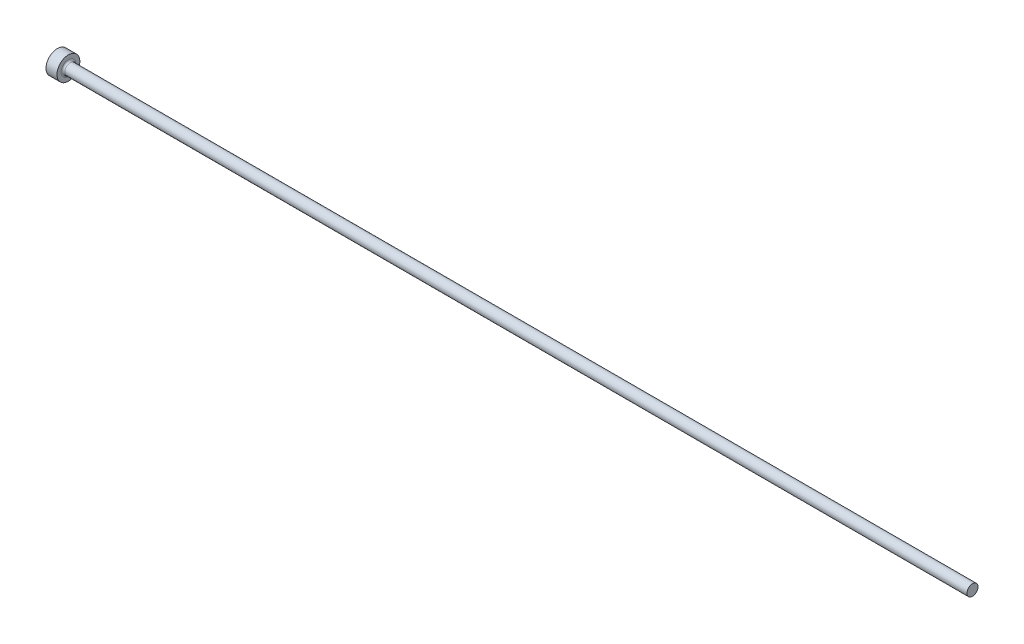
ISO-10303-21;
HEADER;
FILE_DESCRIPTION(('STEP AP214'),'2;1');
FILE_NAME('part.step','',(''),(''),'','','');
FILE_SCHEMA(('AUTOMOTIVE_DESIGN { 1 0 10303 214 1 1 1 1 }'));
ENDSEC;
DATA;
#1=APPLICATION_CONTEXT('core data for automotive mechanical design processes');
#2=APPLICATION_PROTOCOL_DEFINITION('international standard','automotive_design',2000,#1);
#3=PRODUCT_CONTEXT('',#1,'mechanical');
#4=PRODUCT('Part','Part','',(#3));
#5=PRODUCT_RELATED_PRODUCT_CATEGORY('part','',(#4));
#6=PRODUCT_DEFINITION_FORMATION('','',#4);
#7=PRODUCT_DEFINITION_CONTEXT('part definition',#1,'design');
#8=PRODUCT_DEFINITION('design','',#6,#7);
#9=PRODUCT_DEFINITION_SHAPE('','',#8);
#10=(LENGTH_UNIT() NAMED_UNIT(*) SI_UNIT(.MILLI.,.METRE.));
#11=(NAMED_UNIT(*) PLANE_ANGLE_UNIT() SI_UNIT($,.RADIAN.));
#12=(NAMED_UNIT(*) SI_UNIT($,.STERADIAN.) SOLID_ANGLE_UNIT());
#13=UNCERTAINTY_MEASURE_WITH_UNIT(LENGTH_MEASURE(1.E-05),#10,'distance_accuracy_value','');
#14=(GEOMETRIC_REPRESENTATION_CONTEXT(3) GLOBAL_UNCERTAINTY_ASSIGNED_CONTEXT((#13)) GLOBAL_UNIT_ASSIGNED_CONTEXT((#10,
#11,#12)) REPRESENTATION_CONTEXT('',''));
#15=CARTESIAN_POINT('',(0.,0.,0.));
#16=DIRECTION('',(0.,0.,1.));
#17=DIRECTION('',(1.,0.,0.));
#18=AXIS2_PLACEMENT_3D('',#15,#16,#17);
#19=CARTESIAN_POINT('',(0.,0.,0.));
#20=DIRECTION('',(-1.,0.,0.));
#21=DIRECTION('',(0.,-1.,0.));
#22=AXIS2_PLACEMENT_3D('',#19,#20,#21);
#23=PLANE('',#22);
#24=CARTESIAN_POINT('',(0.,0.,0.));
#25=DIRECTION('',(1.,0.,0.));
#26=DIRECTION('',(0.,1.,0.));
#27=AXIS2_PLACEMENT_3D('',#24,#25,#26);
#28=CIRCLE('',#27,1.25);
#29=CARTESIAN_POINT('',(0.,1.25,0.));
#30=VERTEX_POINT('',#29);
#31=EDGE_CURVE('E25',#30,#30,#28,.T.);
#32=ORIENTED_EDGE('',*,*,#31,.F.);
#33=EDGE_LOOP('',(#32));
#34=FACE_BOUND('',#33,.T.);
#35=ADVANCED_FACE('F14',(#34),#23,.T.);
#36=CARTESIAN_POINT('',(100.,0.,0.));
#37=DIRECTION('',(1.,0.,0.));
#38=DIRECTION('',(0.,1.,0.));
#39=AXIS2_PLACEMENT_3D('',#36,#37,#38);
#40=CYLINDRICAL_SURFACE('',#39,1.25);
#41=ORIENTED_EDGE('',*,*,#31,.T.);
#42=EDGE_LOOP('',(#41));
#43=FACE_BOUND('',#42,.T.);
#44=CARTESIAN_POINT('',(1.2,0.,0.));
#45=DIRECTION('',(1.,0.,0.));
#46=DIRECTION('',(0.,1.,0.));
#47=AXIS2_PLACEMENT_3D('',#44,#45,#46);
#48=CIRCLE('',#47,1.25);
#49=CARTESIAN_POINT('',(1.2,1.25,0.));
#50=VERTEX_POINT('',#49);
#51=EDGE_CURVE('E29',#50,#50,#48,.T.);
#52=ORIENTED_EDGE('',*,*,#51,.F.);
#53=EDGE_LOOP('',(#52));
#54=FACE_BOUND('',#53,.T.);
#55=ADVANCED_FACE('F51',(#43,#54),#40,.T.);
#56=CARTESIAN_POINT('',(1.2,1.25,0.));
#57=DIRECTION('',(1.,0.,0.));
#58=DIRECTION('',(0.,1.,0.));
#59=AXIS2_PLACEMENT_3D('',#56,#57,#58);
#60=PLANE('',#59);
#61=CARTESIAN_POINT('',(1.2,0.,0.));
#62=DIRECTION('',(1.,0.,0.));
#63=DIRECTION('',(0.,1.,0.));
#64=AXIS2_PLACEMENT_3D('',#61,#62,#63);
#65=CIRCLE('',#64,0.799999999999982);
#66=CARTESIAN_POINT('',(1.2,0.799999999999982,0.));
#67=VERTEX_POINT('',#66);
#68=EDGE_CURVE('E9',#67,#67,#65,.F.);
#69=ORIENTED_EDGE('',*,*,#68,.T.);
#70=EDGE_LOOP('',(#69));
#71=FACE_BOUND('',#70,.T.);
#72=ORIENTED_EDGE('',*,*,#51,.T.);
#73=EDGE_LOOP('',(#72));
#74=FACE_BOUND('',#73,.T.);
#75=ADVANCED_FACE('F42',(#71,#74),#60,.T.);
#76=CARTESIAN_POINT('',(100.,0.,0.));
#77=DIRECTION('',(1.,0.,0.));
#78=DIRECTION('',(0.,1.,0.));
#79=AXIS2_PLACEMENT_3D('',#76,#77,#78);
#80=CYLINDRICAL_SURFACE('',#79,0.599999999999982);
#81=CARTESIAN_POINT('',(1.4,0.,0.));
#82=DIRECTION('',(1.,0.,0.));
#83=DIRECTION('',(0.,1.,0.));
#84=AXIS2_PLACEMENT_3D('',#81,#82,#83);
#85=CIRCLE('',#84,0.599999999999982);
#86=CARTESIAN_POINT('',(1.4,0.599999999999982,0.));
#87=VERTEX_POINT('',#86);
#88=EDGE_CURVE('E21',#87,#87,#85,.T.);
#89=ORIENTED_EDGE('',*,*,#88,.T.);
#90=EDGE_LOOP('',(#89));
#91=FACE_BOUND('',#90,.T.);
#92=CARTESIAN_POINT('',(100.,0.,0.));
#93=DIRECTION('',(1.,0.,0.));
#94=DIRECTION('',(0.,1.,0.));
#95=AXIS2_PLACEMENT_3D('',#92,#93,#94);
#96=CIRCLE('',#95,0.599999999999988);
#97=CARTESIAN_POINT('',(100.,0.599999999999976,0.));
#98=VERTEX_POINT('',#97);
#99=EDGE_CURVE('E34',#98,#98,#96,.T.);
#100=ORIENTED_EDGE('',*,*,#99,.F.);
#101=EDGE_LOOP('',(#100));
#102=FACE_BOUND('',#101,.T.);
#103=ADVANCED_FACE('F40',(#91,#102),#80,.T.);
#104=CARTESIAN_POINT('',(100.,0.599999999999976,0.));
#105=DIRECTION('',(1.,0.,0.));
#106=DIRECTION('',(0.,1.,0.));
#107=AXIS2_PLACEMENT_3D('',#104,#105,#106);
#108=PLANE('',#107);
#109=ORIENTED_EDGE('',*,*,#99,.T.);
#110=EDGE_LOOP('',(#109));
#111=FACE_BOUND('',#110,.T.);
#112=ADVANCED_FACE('F38',(#111),#108,.T.);
#113=CARTESIAN_POINT('',(1.4,0.,0.));
#114=DIRECTION('',(1.,0.,0.));
#115=DIRECTION('',(0.,1.,0.));
#116=AXIS2_PLACEMENT_3D('',#113,#114,#115);
#117=TOROIDAL_SURFACE('',#116,0.799999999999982,0.2);
#118=ORIENTED_EDGE('',*,*,#68,.F.);
#119=EDGE_LOOP('',(#118));
#120=FACE_BOUND('',#119,.T.);
#121=ORIENTED_EDGE('',*,*,#88,.F.);
#122=EDGE_LOOP('',(#121));
#123=FACE_BOUND('',#122,.T.);
#124=ADVANCED_FACE('F16',(#120,#123),#117,.F.);
#125=CLOSED_SHELL('',(#35,#55,#75,#103,#112,#124));
#126=MANIFOLD_SOLID_BREP('B1',#125);
#127=ADVANCED_BREP_SHAPE_REPRESENTATION('',(#18,#126),#14);
#128=SHAPE_DEFINITION_REPRESENTATION(#9,#127);
ENDSEC;
END-ISO-10303-21;
